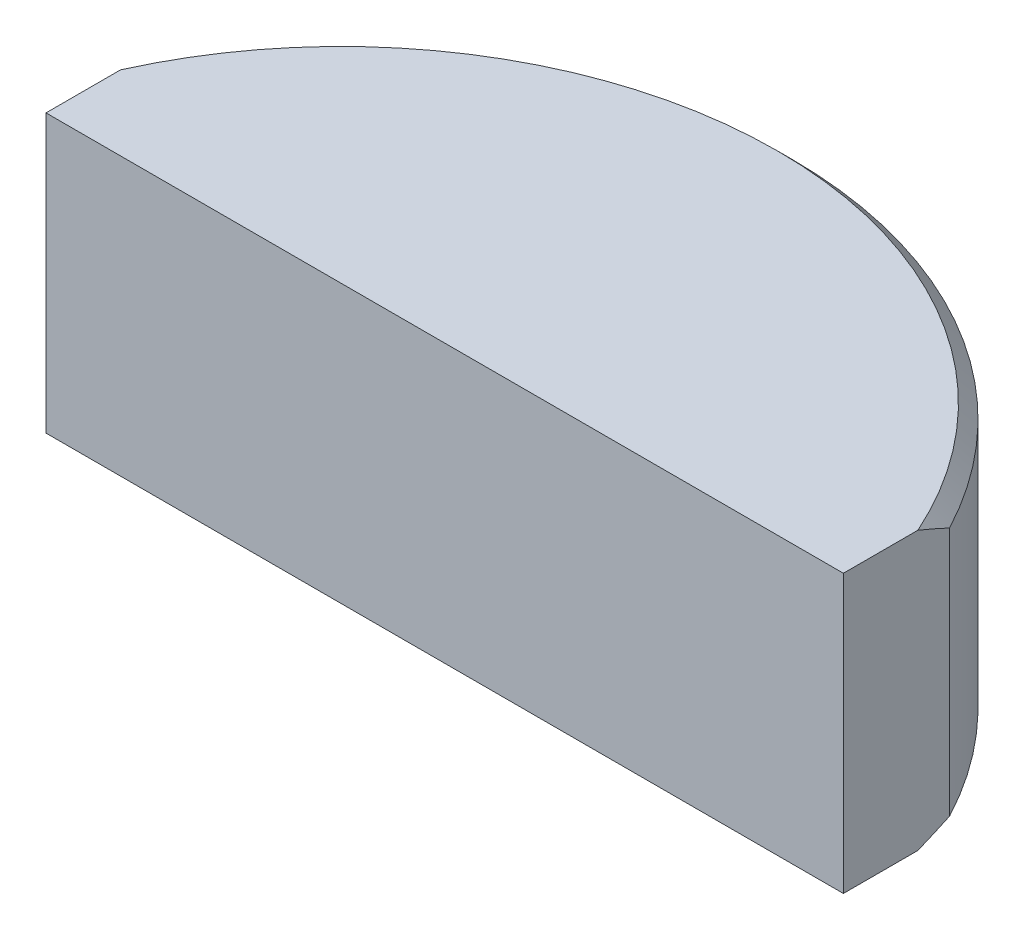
ISO-10303-21;
HEADER;
FILE_DESCRIPTION(('STEP AP214'),'2;1');
FILE_NAME('part.step','',(''),(''),'','','');
FILE_SCHEMA(('AUTOMOTIVE_DESIGN { 1 0 10303 214 1 1 1 1 }'));
ENDSEC;
DATA;
#1=APPLICATION_CONTEXT('core data for automotive mechanical design processes');
#2=APPLICATION_PROTOCOL_DEFINITION('international standard','automotive_design',2000,#1);
#3=PRODUCT_CONTEXT('',#1,'mechanical');
#4=PRODUCT('Part','Part','',(#3));
#5=PRODUCT_RELATED_PRODUCT_CATEGORY('part','',(#4));
#6=PRODUCT_DEFINITION_FORMATION('','',#4);
#7=PRODUCT_DEFINITION_CONTEXT('part definition',#1,'design');
#8=PRODUCT_DEFINITION('design','',#6,#7);
#9=PRODUCT_DEFINITION_SHAPE('','',#8);
#10=(LENGTH_UNIT() NAMED_UNIT(*) SI_UNIT(.MILLI.,.METRE.));
#11=(NAMED_UNIT(*) PLANE_ANGLE_UNIT() SI_UNIT($,.RADIAN.));
#12=(NAMED_UNIT(*) SI_UNIT($,.STERADIAN.) SOLID_ANGLE_UNIT());
#13=UNCERTAINTY_MEASURE_WITH_UNIT(LENGTH_MEASURE(1.E-05),#10,'distance_accuracy_value','');
#14=(GEOMETRIC_REPRESENTATION_CONTEXT(3) GLOBAL_UNCERTAINTY_ASSIGNED_CONTEXT((#13)) GLOBAL_UNIT_ASSIGNED_CONTEXT((#10,
#11,#12)) REPRESENTATION_CONTEXT('',''));
#15=CARTESIAN_POINT('',(0.,0.,0.));
#16=DIRECTION('',(0.,0.,1.));
#17=DIRECTION('',(1.,0.,0.));
#18=AXIS2_PLACEMENT_3D('',#15,#16,#17);
#19=CARTESIAN_POINT('',(0.,-2.,1.5));
#20=DIRECTION('',(0.,-1.,0.));
#21=DIRECTION('',(0.,0.,-1.));
#22=AXIS2_PLACEMENT_3D('',#19,#20,#21);
#23=PLANE('',#22);
#24=DIRECTION('',(-1.,0.,0.));
#25=VECTOR('',#24,1.);
#26=CARTESIAN_POINT('',(5.75,-2.,0.));
#27=LINE('',#26,#25);
#28=CARTESIAN_POINT('',(5.75,-2.,0.));
#29=VERTEX_POINT('',#28);
#30=CARTESIAN_POINT('',(-5.75,-2.,0.));
#31=VERTEX_POINT('',#30);
#32=EDGE_CURVE('E80',#29,#31,#27,.T.);
#33=ORIENTED_EDGE('',*,*,#32,.T.);
#34=DIRECTION('',(0.,0.,-1.));
#35=VECTOR('',#34,1.);
#36=CARTESIAN_POINT('',(-5.75,-2.,0.));
#37=LINE('',#36,#35);
#38=CARTESIAN_POINT('',(-5.75,-2.,-1.0743931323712));
#39=VERTEX_POINT('',#38);
#40=EDGE_CURVE('E85',#31,#39,#37,.T.);
#41=ORIENTED_EDGE('',*,*,#40,.T.);
#42=CARTESIAN_POINT('',(0.,-2.,1.5));
#43=DIRECTION('',(0.,-1.,0.));
#44=DIRECTION('',(0.,0.,-1.));
#45=AXIS2_PLACEMENT_3D('',#42,#43,#44);
#46=CIRCLE('',#45,6.3);
#47=CARTESIAN_POINT('',(5.75,-2.,-1.0743931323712));
#48=VERTEX_POINT('',#47);
#49=EDGE_CURVE('E10',#39,#48,#46,.T.);
#50=ORIENTED_EDGE('',*,*,#49,.T.);
#51=DIRECTION('',(0.,0.,1.));
#52=VECTOR('',#51,1.);
#53=CARTESIAN_POINT('',(5.75,-2.,-1.53108891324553));
#54=LINE('',#53,#52);
#55=EDGE_CURVE('E70',#48,#29,#54,.T.);
#56=ORIENTED_EDGE('',*,*,#55,.T.);
#57=EDGE_LOOP('',(#33,#41,#50,#56));
#58=FACE_BOUND('',#57,.T.);
#59=ADVANCED_FACE('F16',(#58),#23,.T.);
#60=CARTESIAN_POINT('',(0.,-2.,1.5));
#61=DIRECTION('',(0.,1.,0.));
#62=DIRECTION('',(0.,0.,1.));
#63=AXIS2_PLACEMENT_3D('',#60,#61,#62);
#64=CONICAL_SURFACE('',#63,6.3,0.785398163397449);
#65=ORIENTED_EDGE('',*,*,#49,.F.);
#66=CARTESIAN_POINT('',(-5.75,-2.38954318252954,0.13215505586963));
#67=CARTESIAN_POINT('',(-5.75,-2.33094614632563,-0.120907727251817));
#68=CARTESIAN_POINT('',(-5.75,-2.25790454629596,-0.370083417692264));
#69=CARTESIAN_POINT('',(-5.75,-2.08909463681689,-0.859104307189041));
#70=CARTESIAN_POINT('',(-5.75,-1.99345899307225,-1.09899480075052));
#71=CARTESIAN_POINT('',(-5.75,-1.83710483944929,-1.45256295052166));
#72=CARTESIAN_POINT('',(-5.75,-1.78290904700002,-1.56923881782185));
#73=CARTESIAN_POINT('',(-5.75,-1.67072392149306,-1.80076637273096));
#74=CARTESIAN_POINT('',(-5.75,-1.6127345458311,-1.91561803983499));
#75=CARTESIAN_POINT('',(-5.75,-1.49312640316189,-2.14425371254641));
#76=CARTESIAN_POINT('',(-5.75,-1.43148853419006,-2.25802766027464));
#77=CARTESIAN_POINT('',(-5.75,-1.30532595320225,-2.4839302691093));
#78=CARTESIAN_POINT('',(-5.75,-1.24080192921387,-2.59605931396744));
#79=CARTESIAN_POINT('',(-5.75,-1.17503748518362,-2.70744469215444));
#80=B_SPLINE_CURVE_WITH_KNOTS('',3,(#66,#67,#68,#69,#70,#71,#72,#73,#74,#75,#76,#77,#78,#79),
.UNSPECIFIED.,.F.,.F.,(4,2,2,2,2,2,4),(0.,0.778115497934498,1.55177095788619,1.93767825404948,
2.32358988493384,2.71174009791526,3.09979826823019),.UNSPECIFIED.);
#81=CARTESIAN_POINT('',(-5.75,-1.8,-1.53108891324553));
#82=VERTEX_POINT('',#81);
#83=EDGE_CURVE('E131',#39,#82,#80,.T.);
#84=ORIENTED_EDGE('',*,*,#83,.T.);
#85=CARTESIAN_POINT('',(0.,-1.8,1.5));
#86=DIRECTION('',(0.,-1.,0.));
#87=DIRECTION('',(0.,0.,-1.));
#88=AXIS2_PLACEMENT_3D('',#85,#86,#87);
#89=CIRCLE('',#88,6.5);
#90=CARTESIAN_POINT('',(5.75,-1.8,-1.53108891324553));
#91=VERTEX_POINT('',#90);
#92=EDGE_CURVE('E23',#82,#91,#89,.T.);
#93=ORIENTED_EDGE('',*,*,#92,.T.);
#94=CARTESIAN_POINT('',(5.75,-1.17503748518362,-2.70744469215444));
#95=CARTESIAN_POINT('',(5.75,-1.24080192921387,-2.59605931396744));
#96=CARTESIAN_POINT('',(5.75,-1.30532595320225,-2.4839302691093));
#97=CARTESIAN_POINT('',(5.75,-1.43148853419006,-2.25802766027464));
#98=CARTESIAN_POINT('',(5.75,-1.49312640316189,-2.14425371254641));
#99=CARTESIAN_POINT('',(5.75,-1.6127345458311,-1.91561803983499));
#100=CARTESIAN_POINT('',(5.75,-1.67072392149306,-1.80076637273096));
#101=CARTESIAN_POINT('',(5.75,-1.78290904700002,-1.56923881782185));
#102=CARTESIAN_POINT('',(5.75,-1.83710483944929,-1.45256295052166));
#103=CARTESIAN_POINT('',(5.75,-1.99345899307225,-1.09899480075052));
#104=CARTESIAN_POINT('',(5.75,-2.08909463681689,-0.859104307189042));
#105=CARTESIAN_POINT('',(5.75,-2.25790454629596,-0.370083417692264));
#106=CARTESIAN_POINT('',(5.75,-2.33094614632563,-0.120907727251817));
#107=CARTESIAN_POINT('',(5.75,-2.38954318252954,0.13215505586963));
#108=B_SPLINE_CURVE_WITH_KNOTS('',3,(#94,#95,#96,#97,#98,#99,#100,#101,#102,#103,#104,#105,#106,
#107),.UNSPECIFIED.,.F.,.F.,(4,2,2,2,2,2,4),(0.,0.388058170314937,0.776208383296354,
1.16212001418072,1.548027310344,2.3216827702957,3.09979826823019),.UNSPECIFIED.);
#109=EDGE_CURVE('E106',#91,#48,#108,.T.);
#110=ORIENTED_EDGE('',*,*,#109,.T.);
#111=EDGE_LOOP('',(#65,#84,#93,#110));
#112=FACE_BOUND('',#111,.T.);
#113=ADVANCED_FACE('F138',(#112),#64,.T.);
#114=CARTESIAN_POINT('',(0.,-2.,1.5));
#115=DIRECTION('',(0.,-1.,0.));
#116=DIRECTION('',(0.,0.,-1.));
#117=AXIS2_PLACEMENT_3D('',#114,#115,#116);
#118=CYLINDRICAL_SURFACE('',#117,6.5);
#119=ORIENTED_EDGE('',*,*,#92,.F.);
#120=DIRECTION('',(0.,-1.,0.));
#121=VECTOR('',#120,1.);
#122=CARTESIAN_POINT('',(-5.75,2.,-1.53108891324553));
#123=LINE('',#122,#121);
#124=CARTESIAN_POINT('',(-5.75,1.8,-1.53108891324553));
#125=VERTEX_POINT('',#124);
#126=EDGE_CURVE('E38',#125,#82,#123,.T.);
#127=ORIENTED_EDGE('',*,*,#126,.F.);
#128=CARTESIAN_POINT('',(0.,1.8,1.5));
#129=DIRECTION('',(0.,-1.,0.));
#130=DIRECTION('',(0.,0.,-1.));
#131=AXIS2_PLACEMENT_3D('',#128,#129,#130);
#132=CIRCLE('',#131,6.5);
#133=CARTESIAN_POINT('',(5.75,1.8,-1.53108891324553));
#134=VERTEX_POINT('',#133);
#135=EDGE_CURVE('E194',#125,#134,#132,.T.);
#136=ORIENTED_EDGE('',*,*,#135,.T.);
#137=DIRECTION('',(0.,-1.,0.));
#138=VECTOR('',#137,1.);
#139=CARTESIAN_POINT('',(5.75,2.,-1.53108891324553));
#140=LINE('',#139,#138);
#141=EDGE_CURVE('E77',#134,#91,#140,.T.);
#142=ORIENTED_EDGE('',*,*,#141,.T.);
#143=EDGE_LOOP('',(#119,#127,#136,#142));
#144=FACE_BOUND('',#143,.T.);
#145=ADVANCED_FACE('F141',(#144),#118,.T.);
#146=CARTESIAN_POINT('',(0.,1.8,1.5));
#147=DIRECTION('',(0.,-1.,0.));
#148=DIRECTION('',(0.,0.,-1.));
#149=AXIS2_PLACEMENT_3D('',#146,#147,#148);
#150=CONICAL_SURFACE('',#149,6.5,0.785398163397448);
#151=ORIENTED_EDGE('',*,*,#135,.F.);
#152=CARTESIAN_POINT('',(-5.75,1.17503748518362,-2.70744469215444));
#153=CARTESIAN_POINT('',(-5.75,1.24080192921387,-2.59605931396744));
#154=CARTESIAN_POINT('',(-5.75,1.30532595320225,-2.4839302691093));
#155=CARTESIAN_POINT('',(-5.75,1.43148853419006,-2.25802766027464));
#156=CARTESIAN_POINT('',(-5.75,1.49312640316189,-2.14425371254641));
#157=CARTESIAN_POINT('',(-5.75,1.6127345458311,-1.91561803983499));
#158=CARTESIAN_POINT('',(-5.75,1.67072392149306,-1.80076637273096));
#159=CARTESIAN_POINT('',(-5.75,1.78290904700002,-1.56923881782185));
#160=CARTESIAN_POINT('',(-5.75,1.83710483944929,-1.45256295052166));
#161=CARTESIAN_POINT('',(-5.75,1.99345899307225,-1.09899480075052));
#162=CARTESIAN_POINT('',(-5.75,2.08909463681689,-0.859104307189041));
#163=CARTESIAN_POINT('',(-5.75,2.25790454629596,-0.370083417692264));
#164=CARTESIAN_POINT('',(-5.75,2.33094614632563,-0.120907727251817));
#165=CARTESIAN_POINT('',(-5.75,2.38954318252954,0.13215505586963));
#166=B_SPLINE_CURVE_WITH_KNOTS('',3,(#152,#153,#154,#155,#156,#157,#158,#159,#160,#161,#162,
#163,#164,#165),.UNSPECIFIED.,.F.,.F.,(4,2,2,2,2,2,4),(0.,0.388058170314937,0.776208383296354,
1.16212001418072,1.548027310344,2.3216827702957,3.09979826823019),.UNSPECIFIED.);
#167=CARTESIAN_POINT('',(-5.75,2.,-1.0743931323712));
#168=VERTEX_POINT('',#167);
#169=EDGE_CURVE('E126',#125,#168,#166,.T.);
#170=ORIENTED_EDGE('',*,*,#169,.T.);
#171=CARTESIAN_POINT('',(0.,2.,1.5));
#172=DIRECTION('',(0.,-1.,0.));
#173=DIRECTION('',(0.,0.,-1.));
#174=AXIS2_PLACEMENT_3D('',#171,#172,#173);
#175=CIRCLE('',#174,6.3);
#176=CARTESIAN_POINT('',(5.75,2.,-1.0743931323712));
#177=VERTEX_POINT('',#176);
#178=EDGE_CURVE('E136',#168,#177,#175,.T.);
#179=ORIENTED_EDGE('',*,*,#178,.T.);
#180=CARTESIAN_POINT('',(5.75,2.38954318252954,0.13215505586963));
#181=CARTESIAN_POINT('',(5.75,2.33094614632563,-0.120907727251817));
#182=CARTESIAN_POINT('',(5.75,2.25790454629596,-0.370083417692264));
#183=CARTESIAN_POINT('',(5.75,2.08909463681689,-0.859104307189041));
#184=CARTESIAN_POINT('',(5.75,1.99345899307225,-1.09899480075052));
#185=CARTESIAN_POINT('',(5.75,1.83710483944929,-1.45256295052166));
#186=CARTESIAN_POINT('',(5.75,1.78290904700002,-1.56923881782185));
#187=CARTESIAN_POINT('',(5.75,1.67072392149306,-1.80076637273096));
#188=CARTESIAN_POINT('',(5.75,1.6127345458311,-1.91561803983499));
#189=CARTESIAN_POINT('',(5.75,1.49312640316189,-2.14425371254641));
#190=CARTESIAN_POINT('',(5.75,1.43148853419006,-2.25802766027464));
#191=CARTESIAN_POINT('',(5.75,1.30532595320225,-2.4839302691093));
#192=CARTESIAN_POINT('',(5.75,1.24080192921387,-2.59605931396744));
#193=CARTESIAN_POINT('',(5.75,1.17503748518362,-2.70744469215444));
#194=B_SPLINE_CURVE_WITH_KNOTS('',3,(#180,#181,#182,#183,#184,#185,#186,#187,#188,#189,#190,
#191,#192,#193),.UNSPECIFIED.,.F.,.F.,(4,2,2,2,2,2,4),(0.,0.778115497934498,1.55177095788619,
1.93767825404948,2.32358988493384,2.71174009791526,3.09979826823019),.UNSPECIFIED.);
#195=EDGE_CURVE('E30',#177,#134,#194,.T.);
#196=ORIENTED_EDGE('',*,*,#195,.T.);
#197=EDGE_LOOP('',(#151,#170,#179,#196));
#198=FACE_BOUND('',#197,.T.);
#199=ADVANCED_FACE('F111',(#198),#150,.T.);
#200=CARTESIAN_POINT('',(-6.3,2.,1.5));
#201=DIRECTION('',(0.,1.,0.));
#202=DIRECTION('',(0.,0.,1.));
#203=AXIS2_PLACEMENT_3D('',#200,#201,#202);
#204=PLANE('',#203);
#205=ORIENTED_EDGE('',*,*,#178,.F.);
#206=DIRECTION('',(0.,0.,-1.));
#207=VECTOR('',#206,1.);
#208=CARTESIAN_POINT('',(-5.75,2.,0.));
#209=LINE('',#208,#207);
#210=CARTESIAN_POINT('',(-5.75,2.,0.));
#211=VERTEX_POINT('',#210);
#212=EDGE_CURVE('E88',#211,#168,#209,.T.);
#213=ORIENTED_EDGE('',*,*,#212,.F.);
#214=DIRECTION('',(-1.,0.,0.));
#215=VECTOR('',#214,1.);
#216=CARTESIAN_POINT('',(5.75,2.,0.));
#217=LINE('',#216,#215);
#218=CARTESIAN_POINT('',(5.75,2.,0.));
#219=VERTEX_POINT('',#218);
#220=EDGE_CURVE('E90',#219,#211,#217,.T.);
#221=ORIENTED_EDGE('',*,*,#220,.F.);
#222=DIRECTION('',(0.,0.,1.));
#223=VECTOR('',#222,1.);
#224=CARTESIAN_POINT('',(5.75,2.,-1.53108891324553));
#225=LINE('',#224,#223);
#226=EDGE_CURVE('E72',#177,#219,#225,.T.);
#227=ORIENTED_EDGE('',*,*,#226,.F.);
#228=EDGE_LOOP('',(#205,#213,#221,#227));
#229=FACE_BOUND('',#228,.T.);
#230=ADVANCED_FACE('F124',(#229),#204,.T.);
#231=CARTESIAN_POINT('',(-5.75,2.,0.));
#232=DIRECTION('',(-1.,0.,0.));
#233=DIRECTION('',(0.,1.,0.));
#234=AXIS2_PLACEMENT_3D('',#231,#232,#233);
#235=PLANE('',#234);
#236=ORIENTED_EDGE('',*,*,#40,.F.);
#237=DIRECTION('',(0.,-1.,0.));
#238=VECTOR('',#237,1.);
#239=CARTESIAN_POINT('',(-5.75,2.,0.));
#240=LINE('',#239,#238);
#241=EDGE_CURVE('E76',#211,#31,#240,.T.);
#242=ORIENTED_EDGE('',*,*,#241,.F.);
#243=ORIENTED_EDGE('',*,*,#212,.T.);
#244=ORIENTED_EDGE('',*,*,#169,.F.);
#245=ORIENTED_EDGE('',*,*,#126,.T.);
#246=ORIENTED_EDGE('',*,*,#83,.F.);
#247=EDGE_LOOP('',(#236,#242,#243,#244,#245,#246));
#248=FACE_BOUND('',#247,.T.);
#249=ADVANCED_FACE('F121',(#248),#235,.T.);
#250=CARTESIAN_POINT('',(5.75,2.,0.));
#251=DIRECTION('',(0.,0.,1.));
#252=DIRECTION('',(0.,-1.,0.));
#253=AXIS2_PLACEMENT_3D('',#250,#251,#252);
#254=PLANE('',#253);
#255=ORIENTED_EDGE('',*,*,#32,.F.);
#256=DIRECTION('',(0.,-1.,0.));
#257=VECTOR('',#256,1.);
#258=CARTESIAN_POINT('',(5.75,2.,0.));
#259=LINE('',#258,#257);
#260=EDGE_CURVE('E66',#219,#29,#259,.T.);
#261=ORIENTED_EDGE('',*,*,#260,.F.);
#262=ORIENTED_EDGE('',*,*,#220,.T.);
#263=ORIENTED_EDGE('',*,*,#241,.T.);
#264=EDGE_LOOP('',(#255,#261,#262,#263));
#265=FACE_BOUND('',#264,.T.);
#266=ADVANCED_FACE('F81',(#265),#254,.T.);
#267=CARTESIAN_POINT('',(5.75,2.,-1.53108891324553));
#268=DIRECTION('',(1.,0.,0.));
#269=DIRECTION('',(0.,-1.,0.));
#270=AXIS2_PLACEMENT_3D('',#267,#268,#269);
#271=PLANE('',#270);
#272=ORIENTED_EDGE('',*,*,#141,.F.);
#273=ORIENTED_EDGE('',*,*,#195,.F.);
#274=ORIENTED_EDGE('',*,*,#226,.T.);
#275=ORIENTED_EDGE('',*,*,#260,.T.);
#276=ORIENTED_EDGE('',*,*,#55,.F.);
#277=ORIENTED_EDGE('',*,*,#109,.F.);
#278=EDGE_LOOP('',(#272,#273,#274,#275,#276,#277));
#279=FACE_BOUND('',#278,.T.);
#280=ADVANCED_FACE('F68',(#279),#271,.T.);
#281=CLOSED_SHELL('',(#59,#113,#145,#199,#230,#249,#266,#280));
#282=MANIFOLD_SOLID_BREP('B1',#281);
#283=ADVANCED_BREP_SHAPE_REPRESENTATION('',(#18,#282),#14);
#284=SHAPE_DEFINITION_REPRESENTATION(#9,#283);
ENDSEC;
END-ISO-10303-21;
